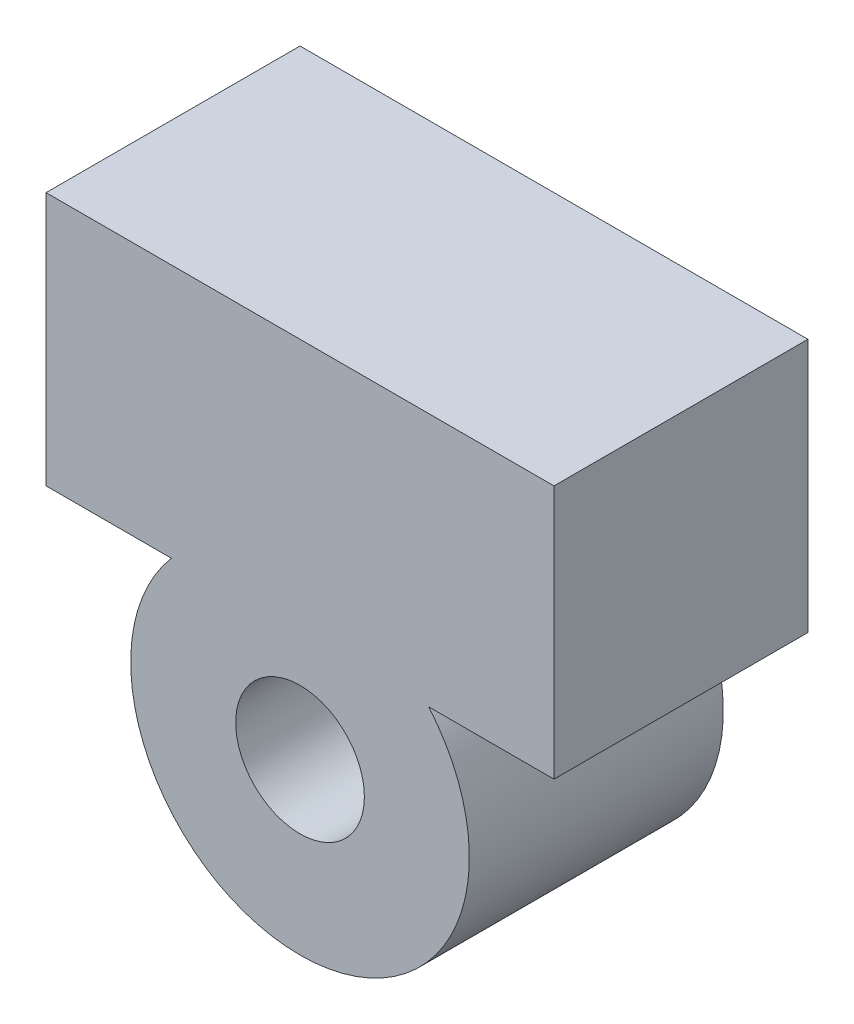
from build123d import *

# Parameters (mm, degrees)
SALIENTE_EXTRUIR1_DEPTH = 30
CROQUIS2_R              = 7.6
CORTAR_EXTRUIR1_DEPTH   = 61.407606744


with BuildPart() as part:
    # Croquis1 → Saliente-Extruir1 (new body)
    with BuildSketch(Plane.XY):
        with BuildLine():
            Line((-15.198684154, 13), (-30.001315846, 13))
            Line((-30.001315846, 13), (-30.001315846, 43))
            Line((-30.001315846, 43), (29.998684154, 43))
            Line((29.998684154, 43), (29.998684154, 13))
            Line((29.998684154, 13), (15.198684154, 13))
            ThreePointArc((15.198684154, 13), (0, -20), (-15.198684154, 13))
        make_face()
    extrude(amount=SALIENTE_EXTRUIR1_DEPTH)

    # Croquis2 → Cortar-Extruir1 (cut, through all)
    with BuildSketch(Plane.XY.offset(30)):
        Circle(CROQUIS2_R)
    extrude(amount=-CORTAR_EXTRUIR1_DEPTH, mode=Mode.SUBTRACT)


solid = part.part
